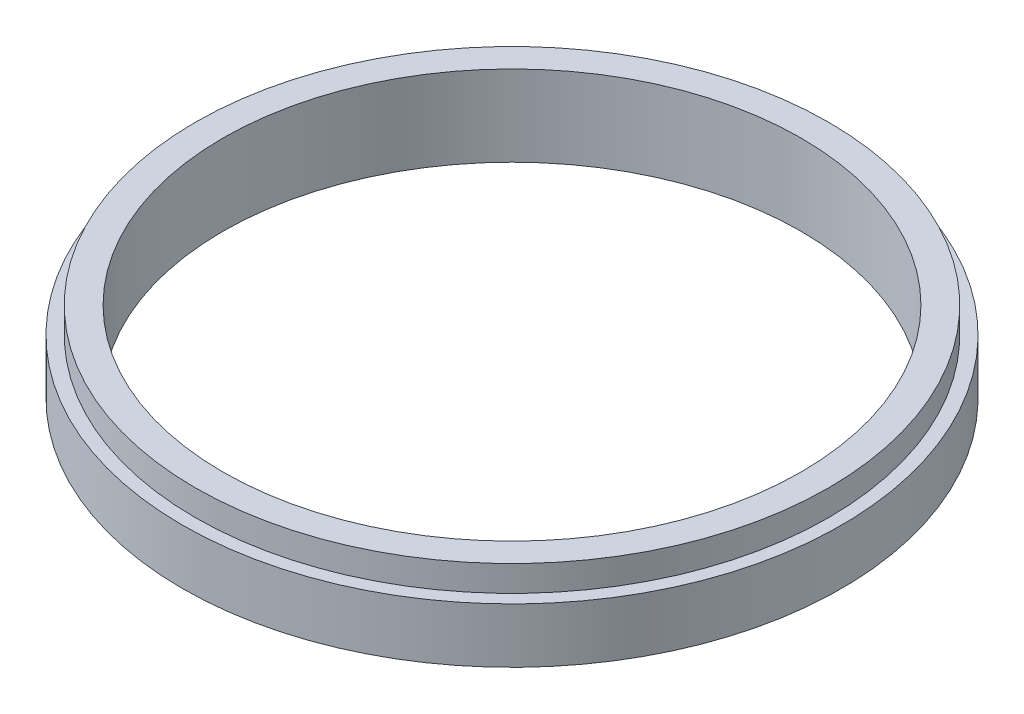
ISO-10303-21;
HEADER;
FILE_DESCRIPTION(('STEP AP214'),'2;1');
FILE_NAME('part.step','',(''),(''),'','','');
FILE_SCHEMA(('AUTOMOTIVE_DESIGN { 1 0 10303 214 1 1 1 1 }'));
ENDSEC;
DATA;
#1=APPLICATION_CONTEXT('core data for automotive mechanical design processes');
#2=APPLICATION_PROTOCOL_DEFINITION('international standard','automotive_design',2000,#1);
#3=PRODUCT_CONTEXT('',#1,'mechanical');
#4=PRODUCT('Part','Part','',(#3));
#5=PRODUCT_RELATED_PRODUCT_CATEGORY('part','',(#4));
#6=PRODUCT_DEFINITION_FORMATION('','',#4);
#7=PRODUCT_DEFINITION_CONTEXT('part definition',#1,'design');
#8=PRODUCT_DEFINITION('design','',#6,#7);
#9=PRODUCT_DEFINITION_SHAPE('','',#8);
#10=(LENGTH_UNIT() NAMED_UNIT(*) SI_UNIT(.MILLI.,.METRE.));
#11=(NAMED_UNIT(*) PLANE_ANGLE_UNIT() SI_UNIT($,.RADIAN.));
#12=(NAMED_UNIT(*) SI_UNIT($,.STERADIAN.) SOLID_ANGLE_UNIT());
#13=UNCERTAINTY_MEASURE_WITH_UNIT(LENGTH_MEASURE(1.E-05),#10,'distance_accuracy_value','');
#14=(GEOMETRIC_REPRESENTATION_CONTEXT(3) GLOBAL_UNCERTAINTY_ASSIGNED_CONTEXT((#13)) GLOBAL_UNIT_ASSIGNED_CONTEXT((#10,
#11,#12)) REPRESENTATION_CONTEXT('',''));
#15=CARTESIAN_POINT('',(0.,0.,0.));
#16=DIRECTION('',(0.,0.,1.));
#17=DIRECTION('',(1.,0.,0.));
#18=AXIS2_PLACEMENT_3D('',#15,#16,#17);
#19=CARTESIAN_POINT('',(0.,4.25,0.));
#20=DIRECTION('',(0.,1.,0.));
#21=DIRECTION('',(0.,0.,1.));
#22=AXIS2_PLACEMENT_3D('',#19,#20,#21);
#23=PLANE('',#22);
#24=CARTESIAN_POINT('',(0.,4.25,0.));
#25=DIRECTION('',(0.,1.,0.));
#26=DIRECTION('',(0.,0.,1.));
#27=AXIS2_PLACEMENT_3D('',#24,#25,#26);
#28=CIRCLE('',#27,25.5);
#29=CARTESIAN_POINT('',(0.,4.25,25.5));
#30=VERTEX_POINT('',#29);
#31=EDGE_CURVE('E12',#30,#30,#28,.T.);
#32=ORIENTED_EDGE('',*,*,#31,.T.);
#33=EDGE_LOOP('',(#32));
#34=FACE_BOUND('',#33,.T.);
#35=CARTESIAN_POINT('',(0.,4.25,0.));
#36=DIRECTION('',(0.,1.,0.));
#37=DIRECTION('',(0.,0.,1.));
#38=AXIS2_PLACEMENT_3D('',#35,#36,#37);
#39=CIRCLE('',#38,24.5);
#40=CARTESIAN_POINT('',(0.,4.25,24.5));
#41=VERTEX_POINT('',#40);
#42=EDGE_CURVE('E65',#41,#41,#39,.T.);
#43=ORIENTED_EDGE('',*,*,#42,.F.);
#44=EDGE_LOOP('',(#43));
#45=FACE_BOUND('',#44,.T.);
#46=ADVANCED_FACE('F48',(#34,#45),#23,.T.);
#47=CARTESIAN_POINT('',(0.,4.25,0.));
#48=DIRECTION('',(0.,-1.,0.));
#49=DIRECTION('',(0.,0.,-1.));
#50=AXIS2_PLACEMENT_3D('',#47,#48,#49);
#51=CYLINDRICAL_SURFACE('',#50,25.5);
#52=ORIENTED_EDGE('',*,*,#31,.F.);
#53=EDGE_LOOP('',(#52));
#54=FACE_BOUND('',#53,.T.);
#55=CARTESIAN_POINT('',(0.,0.,0.));
#56=DIRECTION('',(0.,1.,0.));
#57=DIRECTION('',(0.,0.,1.));
#58=AXIS2_PLACEMENT_3D('',#55,#56,#57);
#59=CIRCLE('',#58,25.5);
#60=CARTESIAN_POINT('',(0.,0.,25.5));
#61=VERTEX_POINT('',#60);
#62=EDGE_CURVE('E52',#61,#61,#59,.T.);
#63=ORIENTED_EDGE('',*,*,#62,.T.);
#64=EDGE_LOOP('',(#63));
#65=FACE_BOUND('',#64,.T.);
#66=ADVANCED_FACE('F50',(#54,#65),#51,.T.);
#67=CARTESIAN_POINT('',(0.,0.,0.));
#68=DIRECTION('',(0.,1.,0.));
#69=DIRECTION('',(0.,0.,1.));
#70=AXIS2_PLACEMENT_3D('',#67,#68,#69);
#71=PLANE('',#70);
#72=CARTESIAN_POINT('',(0.,0.,0.));
#73=DIRECTION('',(0.,-1.,0.));
#74=DIRECTION('',(0.,0.,-1.));
#75=AXIS2_PLACEMENT_3D('',#72,#73,#74);
#76=CIRCLE('',#75,22.375);
#77=CARTESIAN_POINT('',(0.,0.,-22.375));
#78=VERTEX_POINT('',#77);
#79=EDGE_CURVE('E73',#78,#78,#76,.T.);
#80=ORIENTED_EDGE('',*,*,#79,.F.);
#81=EDGE_LOOP('',(#80));
#82=FACE_BOUND('',#81,.T.);
#83=ORIENTED_EDGE('',*,*,#62,.F.);
#84=EDGE_LOOP('',(#83));
#85=FACE_BOUND('',#84,.T.);
#86=ADVANCED_FACE('F91',(#82,#85),#71,.F.);
#87=CARTESIAN_POINT('',(0.,6.25,0.));
#88=DIRECTION('',(0.,-1.,0.));
#89=DIRECTION('',(0.,0.,-1.));
#90=AXIS2_PLACEMENT_3D('',#87,#88,#89);
#91=CYLINDRICAL_SURFACE('',#90,24.5);
#92=CARTESIAN_POINT('',(0.,6.25,0.));
#93=DIRECTION('',(0.,1.,0.));
#94=DIRECTION('',(0.,0.,1.));
#95=AXIS2_PLACEMENT_3D('',#92,#93,#94);
#96=CIRCLE('',#95,24.5);
#97=CARTESIAN_POINT('',(0.,6.25,24.5));
#98=VERTEX_POINT('',#97);
#99=EDGE_CURVE('E63',#98,#98,#96,.T.);
#100=ORIENTED_EDGE('',*,*,#99,.F.);
#101=EDGE_LOOP('',(#100));
#102=FACE_BOUND('',#101,.T.);
#103=ORIENTED_EDGE('',*,*,#42,.T.);
#104=EDGE_LOOP('',(#103));
#105=FACE_BOUND('',#104,.T.);
#106=ADVANCED_FACE('F94',(#102,#105),#91,.T.);
#107=CARTESIAN_POINT('',(0.,6.25,0.));
#108=DIRECTION('',(0.,1.,0.));
#109=DIRECTION('',(0.,0.,1.));
#110=AXIS2_PLACEMENT_3D('',#107,#108,#109);
#111=PLANE('',#110);
#112=CARTESIAN_POINT('',(0.,6.25,0.));
#113=DIRECTION('',(0.,-1.,0.));
#114=DIRECTION('',(0.,0.,-1.));
#115=AXIS2_PLACEMENT_3D('',#112,#113,#114);
#116=CIRCLE('',#115,22.375);
#117=CARTESIAN_POINT('',(0.,6.25,-22.375));
#118=VERTEX_POINT('',#117);
#119=EDGE_CURVE('E69',#118,#118,#116,.T.);
#120=ORIENTED_EDGE('',*,*,#119,.T.);
#121=EDGE_LOOP('',(#120));
#122=FACE_BOUND('',#121,.T.);
#123=ORIENTED_EDGE('',*,*,#99,.T.);
#124=EDGE_LOOP('',(#123));
#125=FACE_BOUND('',#124,.T.);
#126=ADVANCED_FACE('F82',(#122,#125),#111,.T.);
#127=CARTESIAN_POINT('',(0.,6.25,0.));
#128=DIRECTION('',(0.,-1.,0.));
#129=DIRECTION('',(0.,0.,-1.));
#130=AXIS2_PLACEMENT_3D('',#127,#128,#129);
#131=CYLINDRICAL_SURFACE('',#130,22.375);
#132=ORIENTED_EDGE('',*,*,#119,.F.);
#133=EDGE_LOOP('',(#132));
#134=FACE_BOUND('',#133,.T.);
#135=ORIENTED_EDGE('',*,*,#79,.T.);
#136=EDGE_LOOP('',(#135));
#137=FACE_BOUND('',#136,.T.);
#138=ADVANCED_FACE('F85',(#134,#137),#131,.F.);
#139=CLOSED_SHELL('',(#46,#66,#86,#106,#126,#138));
#140=MANIFOLD_SOLID_BREP('B2',#139);
#141=ADVANCED_BREP_SHAPE_REPRESENTATION('',(#18,#140),#14);
#142=SHAPE_DEFINITION_REPRESENTATION(#9,#141);
ENDSEC;
END-ISO-10303-21;
